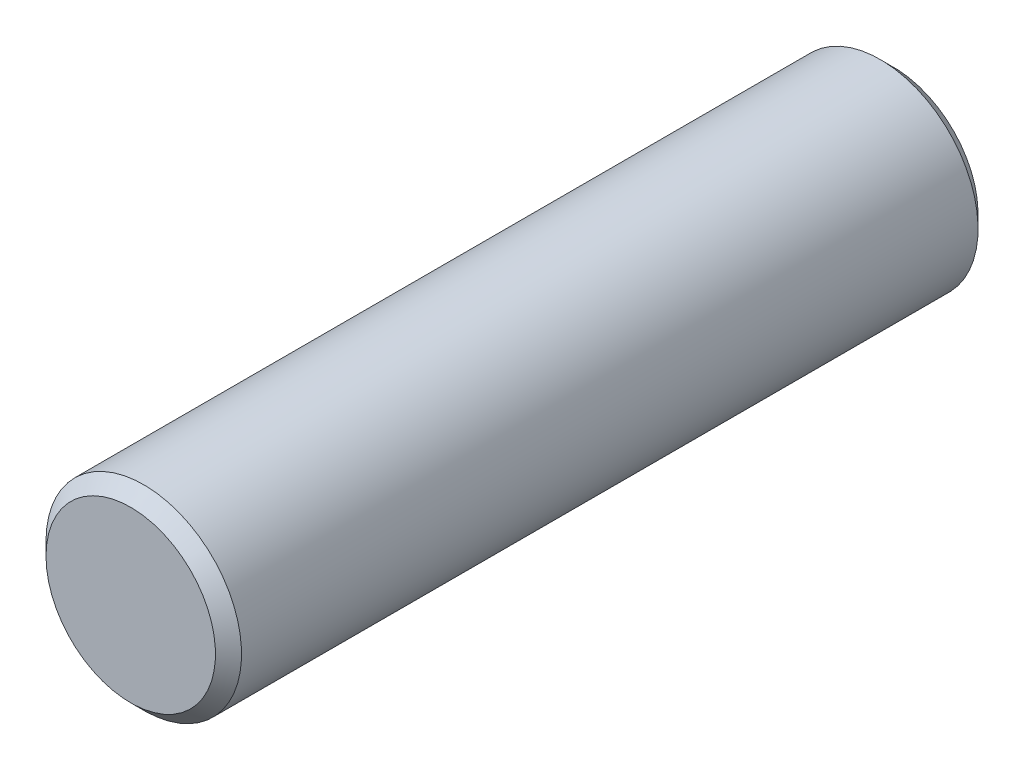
ISO-10303-21;
HEADER;
FILE_DESCRIPTION(('STEP AP214'),'2;1');
FILE_NAME('part.step','',(''),(''),'','','');
FILE_SCHEMA(('AUTOMOTIVE_DESIGN { 1 0 10303 214 1 1 1 1 }'));
ENDSEC;
DATA;
#1=APPLICATION_CONTEXT('core data for automotive mechanical design processes');
#2=APPLICATION_PROTOCOL_DEFINITION('international standard','automotive_design',2000,#1);
#3=PRODUCT_CONTEXT('',#1,'mechanical');
#4=PRODUCT('Part','Part','',(#3));
#5=PRODUCT_RELATED_PRODUCT_CATEGORY('part','',(#4));
#6=PRODUCT_DEFINITION_FORMATION('','',#4);
#7=PRODUCT_DEFINITION_CONTEXT('part definition',#1,'design');
#8=PRODUCT_DEFINITION('design','',#6,#7);
#9=PRODUCT_DEFINITION_SHAPE('','',#8);
#10=(LENGTH_UNIT() NAMED_UNIT(*) SI_UNIT(.MILLI.,.METRE.));
#11=(NAMED_UNIT(*) PLANE_ANGLE_UNIT() SI_UNIT($,.RADIAN.));
#12=(NAMED_UNIT(*) SI_UNIT($,.STERADIAN.) SOLID_ANGLE_UNIT());
#13=UNCERTAINTY_MEASURE_WITH_UNIT(LENGTH_MEASURE(1.E-05),#10,'distance_accuracy_value','');
#14=(GEOMETRIC_REPRESENTATION_CONTEXT(3) GLOBAL_UNCERTAINTY_ASSIGNED_CONTEXT((#13)) GLOBAL_UNIT_ASSIGNED_CONTEXT((#10,
#11,#12)) REPRESENTATION_CONTEXT('',''));
#15=CARTESIAN_POINT('',(0.,0.,0.));
#16=DIRECTION('',(0.,0.,1.));
#17=DIRECTION('',(1.,0.,0.));
#18=AXIS2_PLACEMENT_3D('',#15,#16,#17);
#19=CARTESIAN_POINT('',(0.,0.,11.7));
#20=DIRECTION('',(0.,0.,1.));
#21=DIRECTION('',(1.,0.,0.));
#22=AXIS2_PLACEMENT_3D('',#19,#20,#21);
#23=PLANE('',#22);
#24=CARTESIAN_POINT('',(0.,0.,11.7000000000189));
#25=DIRECTION('',(0.,0.,-1.));
#26=DIRECTION('',(-1.,0.,0.));
#27=AXIS2_PLACEMENT_3D('',#24,#25,#26);
#28=CIRCLE('',#27,1.30000000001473);
#29=CARTESIAN_POINT('',(-1.30000000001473,0.,11.7000000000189));
#30=VERTEX_POINT('',#29);
#31=EDGE_CURVE('E17',#30,#30,#28,.T.);
#32=ORIENTED_EDGE('',*,*,#31,.F.);
#33=EDGE_LOOP('',(#32));
#34=FACE_BOUND('',#33,.T.);
#35=ADVANCED_FACE('F14',(#34),#23,.T.);
#36=CARTESIAN_POINT('',(0.,0.,0.));
#37=DIRECTION('',(0.,0.,1.));
#38=DIRECTION('',(1.,0.,0.));
#39=AXIS2_PLACEMENT_3D('',#36,#37,#38);
#40=PLANE('',#39);
#41=CARTESIAN_POINT('',(0.,0.,0.));
#42=DIRECTION('',(0.,0.,1.));
#43=DIRECTION('',(0.,-1.,0.));
#44=AXIS2_PLACEMENT_3D('',#41,#42,#43);
#45=CIRCLE('',#44,1.29999999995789);
#46=CARTESIAN_POINT('',(0.,-1.29999999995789,0.));
#47=VERTEX_POINT('',#46);
#48=EDGE_CURVE('E26',#47,#47,#45,.T.);
#49=ORIENTED_EDGE('',*,*,#48,.F.);
#50=EDGE_LOOP('',(#49));
#51=FACE_BOUND('',#50,.T.);
#52=ADVANCED_FACE('F37',(#51),#40,.F.);
#53=CARTESIAN_POINT('',(0.,0.,11.500000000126));
#54=DIRECTION('',(0.,0.,-1.));
#55=DIRECTION('',(-1.,0.,0.));
#56=AXIS2_PLACEMENT_3D('',#53,#54,#55);
#57=CONICAL_SURFACE('',#56,1.49999999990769,0.785398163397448);
#58=CARTESIAN_POINT('',(0.,0.,11.5));
#59=DIRECTION('',(0.,0.,-1.));
#60=DIRECTION('',(-1.,0.,0.));
#61=AXIS2_PLACEMENT_3D('',#58,#59,#60);
#62=CIRCLE('',#61,1.5);
#63=CARTESIAN_POINT('',(-1.5,0.,11.5));
#64=VERTEX_POINT('',#63);
#65=EDGE_CURVE('E21',#64,#64,#62,.T.);
#66=ORIENTED_EDGE('',*,*,#65,.F.);
#67=EDGE_LOOP('',(#66));
#68=FACE_BOUND('',#67,.T.);
#69=ORIENTED_EDGE('',*,*,#31,.T.);
#70=EDGE_LOOP('',(#69));
#71=FACE_BOUND('',#70,.T.);
#72=ADVANCED_FACE('F34',(#68,#71),#57,.T.);
#73=CARTESIAN_POINT('',(0.,0.,0.199999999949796));
#74=DIRECTION('',(0.,0.,1.));
#75=DIRECTION('',(0.,-1.,0.));
#76=AXIS2_PLACEMENT_3D('',#73,#74,#75);
#77=CONICAL_SURFACE('',#76,1.49999999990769,0.785398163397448);
#78=CARTESIAN_POINT('',(0.,0.,0.200000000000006));
#79=DIRECTION('',(0.,0.,-1.));
#80=DIRECTION('',(-1.,0.,0.));
#81=AXIS2_PLACEMENT_3D('',#78,#79,#80);
#82=CIRCLE('',#81,1.5);
#83=CARTESIAN_POINT('',(-1.5,0.,0.200000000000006));
#84=VERTEX_POINT('',#83);
#85=EDGE_CURVE('E10',#84,#84,#82,.F.);
#86=ORIENTED_EDGE('',*,*,#85,.F.);
#87=EDGE_LOOP('',(#86));
#88=FACE_BOUND('',#87,.T.);
#89=ORIENTED_EDGE('',*,*,#48,.T.);
#90=EDGE_LOOP('',(#89));
#91=FACE_BOUND('',#90,.T.);
#92=ADVANCED_FACE('F45',(#88,#91),#77,.T.);
#93=CARTESIAN_POINT('',(0.,0.,11.7));
#94=DIRECTION('',(0.,0.,-1.));
#95=DIRECTION('',(-1.,0.,0.));
#96=AXIS2_PLACEMENT_3D('',#93,#94,#95);
#97=CYLINDRICAL_SURFACE('',#96,1.5);
#98=ORIENTED_EDGE('',*,*,#85,.T.);
#99=EDGE_LOOP('',(#98));
#100=FACE_BOUND('',#99,.T.);
#101=ORIENTED_EDGE('',*,*,#65,.T.);
#102=EDGE_LOOP('',(#101));
#103=FACE_BOUND('',#102,.T.);
#104=ADVANCED_FACE('F43',(#100,#103),#97,.T.);
#105=CLOSED_SHELL('',(#35,#52,#72,#92,#104));
#106=MANIFOLD_SOLID_BREP('B1',#105);
#107=ADVANCED_BREP_SHAPE_REPRESENTATION('',(#18,#106),#14);
#108=SHAPE_DEFINITION_REPRESENTATION(#9,#107);
ENDSEC;
END-ISO-10303-21;
